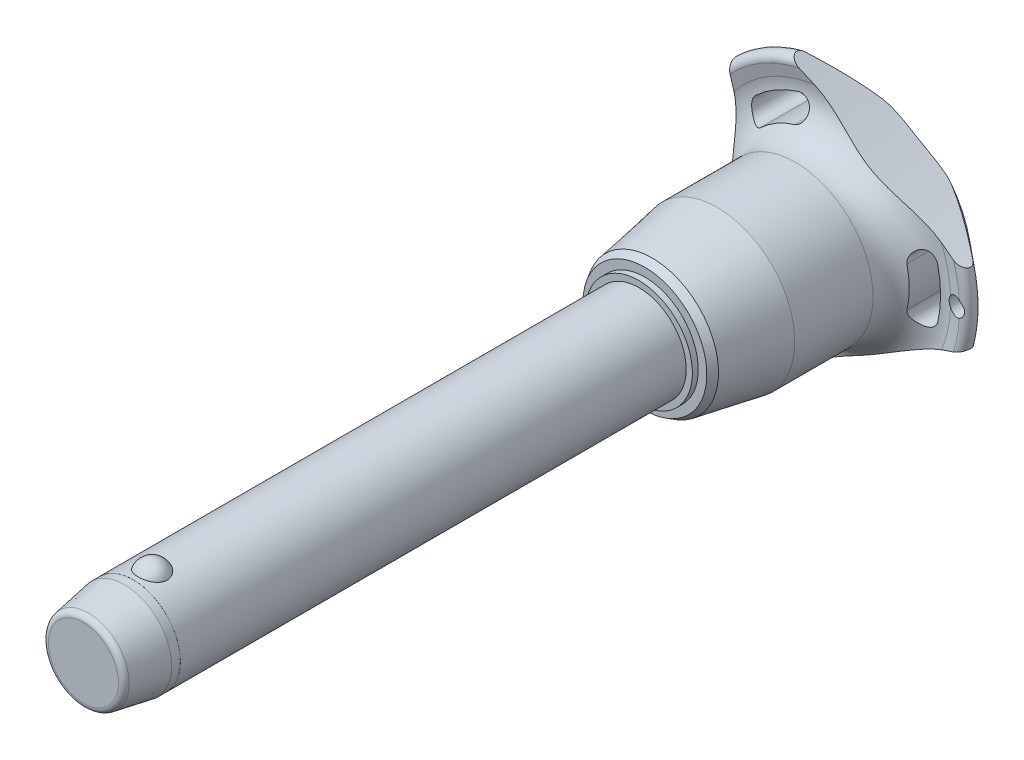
from build123d import *

# Parameters (mm, degrees)
SKETCH1_R           = 8
BOSS_EXTRUDE1_DEPTH = 80
SKETCH2_R           = 7
BOSS_EXTRUDE2_DEPTH = 39.7
BOSS_EXTRUDE3_START = 14
SKETCH1_2_R         = 8
BOSS_EXTRUDE3_DEPTH = 14
CHAMFER1_SIZE       = 7
CHAMFER1_SIZE2      = 1.234288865
FILLET1_R           = 1
SKETCH6_R           = 144.275
CUT_EXTRUDE1_DEPTH  = 125.345019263
CIRPATTERN1_COUNT   = 3
SKETCH7_R           = 1.5
CUT_EXTRUDE2_DEPTH  = 125.183516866
SKETCH8_R           = 8
SKETCH8_R_2         = 7.99
CUT_EXTRUDE3_DEPTH  = 8.4


with BuildPart() as part:
    # Sketch1 → Boss-Extrude1 (new body)
    with BuildSketch(Plane.XY):
        Circle(SKETCH1_R)
    extrude(amount=-BOSS_EXTRUDE1_DEPTH)

    # Sketch2 → Boss-Extrude2 (add)
    with BuildSketch(Plane(origin=(0, 0, -80), x_dir=(-1, 0, 0), z_dir=(0, 0, -1))):
        Circle(SKETCH2_R)
    extrude(amount=BOSS_EXTRUDE2_DEPTH)

    # Sketch3 → Revolve1 (revolve)
    with BuildSketch(Plane(origin=(0, 0, 0), x_dir=(0, 0, -1), z_dir=(1, 0, 0))):
        with BuildLine():
            Line((-2.387467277, 9.5), (-2.387467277, 4.2))
            ThreePointArc((-2.387467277, 4.2), (0.262532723, 6.85), (-2.387467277, 9.5))
        make_face()
        with BuildLine():
            Line((-2.387467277, -4.2), (-2.387467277, -9.5))
            ThreePointArc((-2.387467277, -9.5), (0.262532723, -6.85), (-2.387467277, -4.2))
        make_face()
    revolve(axis=Axis((0, -4.2, 2.387467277), (0, 1, 0)))

    # Sketch1_2 → Boss-Extrude3 (add)
    with BuildSketch(Plane.XY.offset(BOSS_EXTRUDE3_START)):
        Circle(SKETCH1_2_R)
    extrude(amount=-BOSS_EXTRUDE3_DEPTH)

    # Chamfer1
    chamfer1_edges = [part.edges().sort_by_distance(p)[0] for p in [
        (-8, 0, 14),
    ]]
    chamfer1_side = [part.faces().sort_by_distance(p)[0] for p in [
        (-8, 0, -33),
    ]]
    chamfer(chamfer1_edges, length=CHAMFER1_SIZE, length2=CHAMFER1_SIZE2, reference=chamfer1_side[0])

    # Fillet1
    fillet1_edges = [part.edges().sort_by_distance(p)[0] for p in [
        (-6.765711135, 0, 14),
        (7, 0, -119.7),
    ]]
    fillet(fillet1_edges, radius=FILLET1_R)

    # Sketch4 → Revolve2 (revolve)
    with BuildSketch(Plane(origin=(0, 0, 0), x_dir=(0, 0, -1), z_dir=(1, 0, 0)), mode=Mode.PRIVATE) as revolve2_sk:
        Polygon((80, 0), (80, 9.044607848), (81, 9.044607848), (81, 10.490707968), (82.25235944, 11.213758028), (93.233333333, 13.15), (106.466666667, 13.15), (106.466666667, 0), align=None)
    revolve(revolve2_sk.sketch.rotate(Axis((0, 0, -106.466666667), (0, 0, 1)), 90), axis=Axis((0, 0, -106.466666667), (0, 0, 1)))

    # Sketch5 → Revolve3 (revolve)
    with BuildSketch(Plane(origin=(0, 0, 0), x_dir=(0, 0, -1), z_dir=(1, 0, 0)), mode=Mode.PRIVATE) as revolve3_sk:
        with BuildLine():
            Line((112.32877039, 20.428960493), (111.910912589, 22.344207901))
            ThreePointArc((111.910912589, 22.344207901), (112.554394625, 23.677136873), (114.002586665, 23.371345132))
            Line((114.002586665, 23.371345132), (119.141488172, 17.247040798))
            ThreePointArc((119.141488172, 17.247040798), (119.7, 15.584758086), (118.978803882, 13.986322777))
            ThreePointArc((118.978803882, 13.986322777), (114.617427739, 7.589034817), (113.083333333, 0))
            Line((113.083333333, 0), (106.466666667, 0))
            Line((106.466666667, 0), (106.466666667, 13.15))
            ThreePointArc((106.466666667, 13.15), (111.139661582, 15.38660811), (112.32877039, 20.428960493))
        make_face()
    revolve(revolve3_sk.sketch.rotate(Axis((0, 0, -113.083333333), (0, 0, 1)), 90), axis=Axis((0, 0, -113.083333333), (0, 0, 1)))

    # Sketch6 → Cut-Extrude1 (cut, through all)
    with BuildSketch(Plane.XY):
        with Locations((-159.975, 0)):
            Circle(SKETCH6_R)
        with BuildLine():
            ThreePointArc((18.131206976, -4.190753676), (18.60922037, 0), (18.131206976, 4.190753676))
            ThreePointArc((18.131206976, 4.190753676), (15.94840906, 5.553949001), (14.585213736, 3.371151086))
            ThreePointArc((14.585213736, 3.371151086), (14.969740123, 0), (14.585213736, -3.371151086))
            ThreePointArc((14.585213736, -3.371151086), (15.94840906, -5.553949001), (18.131206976, -4.190753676))
        make_face()
    cut_extrude1 = extrude(amount=-CUT_EXTRUDE1_DEPTH, mode=Mode.SUBTRACT)

    # CirPattern1: Cut-Extrude1 ×3 about axis
    cirpattern1_axis = Axis((0, 0, 0), (0, 0, 1))
    for i in range(1, CIRPATTERN1_COUNT):
        add(cut_extrude1.rotate(cirpattern1_axis, i * 360 / CIRPATTERN1_COUNT), mode=Mode.SUBTRACT)

    # Sketch7 → Cut-Extrude2 (cut, through all)
    with BuildSketch(Plane.XY):
        with Locations(Location((21.60922037, 0, 0), (0, 0, 297.620773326))):
            Circle(SKETCH7_R)
    extrude(amount=-CUT_EXTRUDE2_DEPTH, mode=Mode.SUBTRACT)

    # Sketch8 → Cut-Extrude3 (cut)
    with BuildSketch(Plane.XY.offset(14)):
        Circle(SKETCH8_R)
        Circle(SKETCH8_R_2, mode=Mode.SUBTRACT)
    extrude(amount=-CUT_EXTRUDE3_DEPTH, mode=Mode.SUBTRACT)


solid = part.part
